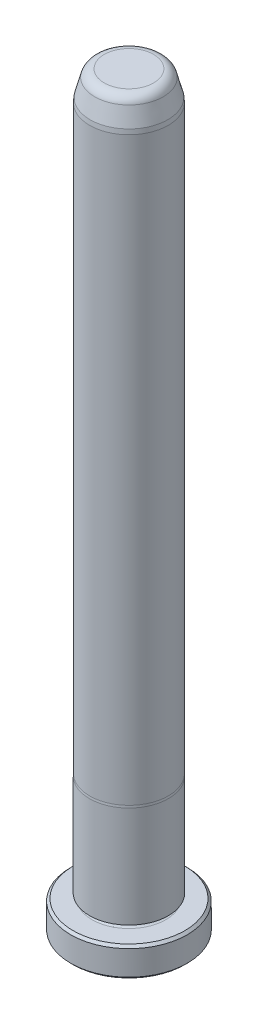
ISO-10303-21;
HEADER;
FILE_DESCRIPTION(('STEP AP214'),'2;1');
FILE_NAME('part.step','',(''),(''),'','','');
FILE_SCHEMA(('AUTOMOTIVE_DESIGN { 1 0 10303 214 1 1 1 1 }'));
ENDSEC;
DATA;
#1=APPLICATION_CONTEXT('core data for automotive mechanical design processes');
#2=APPLICATION_PROTOCOL_DEFINITION('international standard','automotive_design',2000,#1);
#3=PRODUCT_CONTEXT('',#1,'mechanical');
#4=PRODUCT('Part','Part','',(#3));
#5=PRODUCT_RELATED_PRODUCT_CATEGORY('part','',(#4));
#6=PRODUCT_DEFINITION_FORMATION('','',#4);
#7=PRODUCT_DEFINITION_CONTEXT('part definition',#1,'design');
#8=PRODUCT_DEFINITION('design','',#6,#7);
#9=PRODUCT_DEFINITION_SHAPE('','',#8);
#10=(LENGTH_UNIT() NAMED_UNIT(*) SI_UNIT(.MILLI.,.METRE.));
#11=(NAMED_UNIT(*) PLANE_ANGLE_UNIT() SI_UNIT($,.RADIAN.));
#12=(NAMED_UNIT(*) SI_UNIT($,.STERADIAN.) SOLID_ANGLE_UNIT());
#13=UNCERTAINTY_MEASURE_WITH_UNIT(LENGTH_MEASURE(1.E-05),#10,'distance_accuracy_value','');
#14=(GEOMETRIC_REPRESENTATION_CONTEXT(3) GLOBAL_UNCERTAINTY_ASSIGNED_CONTEXT((#13)) GLOBAL_UNIT_ASSIGNED_CONTEXT((#10,
#11,#12)) REPRESENTATION_CONTEXT('',''));
#15=CARTESIAN_POINT('',(0.,0.,0.));
#16=DIRECTION('',(0.,0.,1.));
#17=DIRECTION('',(1.,0.,0.));
#18=AXIS2_PLACEMENT_3D('',#15,#16,#17);
#19=CARTESIAN_POINT('',(0.,0.,0.));
#20=DIRECTION('',(0.,1.,0.));
#21=DIRECTION('',(0.,0.,1.));
#22=AXIS2_PLACEMENT_3D('',#19,#20,#21);
#23=PLANE('',#22);
#24=CARTESIAN_POINT('',(0.,0.,0.));
#25=DIRECTION('',(0.,1.,0.));
#26=DIRECTION('',(0.,0.,1.));
#27=AXIS2_PLACEMENT_3D('',#24,#25,#26);
#28=CIRCLE('',#27,9.01700000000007);
#29=CARTESIAN_POINT('',(0.,-1.43377027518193E-13,9.01700000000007));
#30=VERTEX_POINT('',#29);
#31=EDGE_CURVE('E37',#30,#30,#28,.F.);
#32=ORIENTED_EDGE('',*,*,#31,.T.);
#33=EDGE_LOOP('',(#32));
#34=FACE_BOUND('',#33,.T.);
#35=ADVANCED_FACE('F30',(#34),#23,.F.);
#36=CARTESIAN_POINT('',(0.,0.,0.));
#37=DIRECTION('',(0.,1.,0.));
#38=DIRECTION('',(0.,0.,1.));
#39=AXIS2_PLACEMENT_3D('',#36,#37,#38);
#40=CYLINDRICAL_SURFACE('',#39,9.39800000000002);
#41=CARTESIAN_POINT('',(0.,0.380999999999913,0.));
#42=DIRECTION('',(0.,1.,0.));
#43=DIRECTION('',(0.,0.,1.));
#44=AXIS2_PLACEMENT_3D('',#41,#42,#43);
#45=CIRCLE('',#44,9.39800000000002);
#46=CARTESIAN_POINT('',(0.,0.380999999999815,9.39800000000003));
#47=VERTEX_POINT('',#46);
#48=EDGE_CURVE('E41',#47,#47,#45,.T.);
#49=ORIENTED_EDGE('',*,*,#48,.T.);
#50=EDGE_LOOP('',(#49));
#51=FACE_BOUND('',#50,.T.);
#52=CARTESIAN_POINT('',(0.,4.36879999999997,0.));
#53=DIRECTION('',(0.,-1.,0.));
#54=DIRECTION('',(0.,0.,-1.));
#55=AXIS2_PLACEMENT_3D('',#52,#53,#54);
#56=CIRCLE('',#55,9.39800000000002);
#57=CARTESIAN_POINT('',(0.,4.36880000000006,-9.39799999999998));
#58=VERTEX_POINT('',#57);
#59=EDGE_CURVE('E45',#58,#58,#56,.T.);
#60=ORIENTED_EDGE('',*,*,#59,.T.);
#61=EDGE_LOOP('',(#60));
#62=FACE_BOUND('',#61,.T.);
#63=ADVANCED_FACE('F118',(#51,#62),#40,.T.);
#64=CARTESIAN_POINT('',(0.,4.74980000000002,-9.398));
#65=DIRECTION('',(0.,-1.,0.));
#66=DIRECTION('',(0.,0.,-1.));
#67=AXIS2_PLACEMENT_3D('',#64,#65,#66);
#68=PLANE('',#67);
#69=CARTESIAN_POINT('',(0.,4.74979999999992,0.));
#70=DIRECTION('',(0.,-1.,0.));
#71=DIRECTION('',(0.,0.,-1.));
#72=AXIS2_PLACEMENT_3D('',#69,#70,#71);
#73=CIRCLE('',#72,9.01700000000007);
#74=CARTESIAN_POINT('',(0.,4.74980000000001,-9.01700000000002));
#75=VERTEX_POINT('',#74);
#76=EDGE_CURVE('E10',#75,#75,#73,.F.);
#77=ORIENTED_EDGE('',*,*,#76,.T.);
#78=EDGE_LOOP('',(#77));
#79=FACE_BOUND('',#78,.T.);
#80=CARTESIAN_POINT('',(0.,4.74979999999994,0.));
#81=DIRECTION('',(0.,1.,0.));
#82=DIRECTION('',(0.,0.,1.));
#83=AXIS2_PLACEMENT_3D('',#80,#81,#82);
#84=CIRCLE('',#83,5.95630000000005);
#85=CARTESIAN_POINT('',(0.,4.74979999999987,5.9563000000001));
#86=VERTEX_POINT('',#85);
#87=EDGE_CURVE('E56',#86,#86,#84,.T.);
#88=ORIENTED_EDGE('',*,*,#87,.F.);
#89=EDGE_LOOP('',(#88));
#90=FACE_BOUND('',#89,.T.);
#91=ADVANCED_FACE('F113',(#79,#90),#68,.F.);
#92=CARTESIAN_POINT('',(0.,5.13079999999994,0.));
#93=DIRECTION('',(0.,1.,0.));
#94=DIRECTION('',(0.,0.,1.));
#95=AXIS2_PLACEMENT_3D('',#92,#93,#94);
#96=TOROIDAL_SURFACE('',#95,5.95630000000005,0.381);
#97=CARTESIAN_POINT('',(0.,5.51179999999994,0.));
#98=DIRECTION('',(0.,1.,0.));
#99=DIRECTION('',(0.,0.,1.));
#100=AXIS2_PLACEMENT_3D('',#97,#98,#99);
#101=CIRCLE('',#100,5.95630000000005);
#102=CARTESIAN_POINT('',(0.,5.51179999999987,5.95630000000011));
#103=VERTEX_POINT('',#102);
#104=EDGE_CURVE('E59',#103,#103,#101,.T.);
#105=ORIENTED_EDGE('',*,*,#104,.F.);
#106=EDGE_LOOP('',(#105));
#107=FACE_BOUND('',#106,.T.);
#108=ORIENTED_EDGE('',*,*,#87,.T.);
#109=EDGE_LOOP('',(#108));
#110=FACE_BOUND('',#109,.T.);
#111=ADVANCED_FACE('F107',(#107,#110),#96,.F.);
#112=CARTESIAN_POINT('',(0.,5.5118,-5.9563));
#113=DIRECTION('',(0.,1.,0.));
#114=DIRECTION('',(0.,0.,1.));
#115=AXIS2_PLACEMENT_3D('',#112,#113,#114);
#116=PLANE('',#115);
#117=CARTESIAN_POINT('',(0.,5.51179999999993,0.));
#118=DIRECTION('',(0.,1.,0.));
#119=DIRECTION('',(0.,0.,1.));
#120=AXIS2_PLACEMENT_3D('',#117,#118,#119);
#121=CIRCLE('',#120,6.36270000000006);
#122=CARTESIAN_POINT('',(0.,5.51179999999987,6.36270000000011));
#123=VERTEX_POINT('',#122);
#124=EDGE_CURVE('E62',#123,#123,#121,.T.);
#125=ORIENTED_EDGE('',*,*,#124,.F.);
#126=EDGE_LOOP('',(#125));
#127=FACE_BOUND('',#126,.T.);
#128=ORIENTED_EDGE('',*,*,#104,.T.);
#129=EDGE_LOOP('',(#128));
#130=FACE_BOUND('',#129,.T.);
#131=ADVANCED_FACE('F101',(#127,#130),#116,.F.);
#132=CARTESIAN_POINT('',(0.,0.,0.));
#133=DIRECTION('',(0.,1.,0.));
#134=DIRECTION('',(0.,0.,1.));
#135=AXIS2_PLACEMENT_3D('',#132,#133,#134);
#136=CYLINDRICAL_SURFACE('',#135,6.36270000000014);
#137=CARTESIAN_POINT('',(0.,21.8617630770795,2.28526874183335E-13));
#138=DIRECTION('',(0.,1.,0.));
#139=DIRECTION('',(0.,0.,1.));
#140=AXIS2_PLACEMENT_3D('',#137,#138,#139);
#141=CIRCLE('',#140,6.36270000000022);
#142=CARTESIAN_POINT('',(0.,21.8617630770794,6.36270000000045));
#143=VERTEX_POINT('',#142);
#144=EDGE_CURVE('E65',#143,#143,#141,.T.);
#145=ORIENTED_EDGE('',*,*,#144,.F.);
#146=EDGE_LOOP('',(#145));
#147=FACE_BOUND('',#146,.T.);
#148=ORIENTED_EDGE('',*,*,#124,.T.);
#149=EDGE_LOOP('',(#148));
#150=FACE_BOUND('',#149,.T.);
#151=ADVANCED_FACE('F95',(#147,#150),#136,.T.);
#152=CARTESIAN_POINT('',(0.,21.8617630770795,2.28526874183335E-13));
#153=DIRECTION('',(0.,-1.,0.));
#154=DIRECTION('',(0.,0.,-1.));
#155=AXIS2_PLACEMENT_3D('',#152,#153,#154);
#156=CONICAL_SURFACE('',#155,6.36270000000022,0.0698131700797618);
#157=CARTESIAN_POINT('',(0.,22.2249999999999,2.32323887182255E-13));
#158=DIRECTION('',(0.,1.,0.));
#159=DIRECTION('',(0.,0.,1.));
#160=AXIS2_PLACEMENT_3D('',#157,#158,#159);
#161=CIRCLE('',#160,6.33730000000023);
#162=CARTESIAN_POINT('',(0.,22.2249999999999,6.33730000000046));
#163=VERTEX_POINT('',#162);
#164=EDGE_CURVE('E68',#163,#163,#161,.T.);
#165=ORIENTED_EDGE('',*,*,#164,.F.);
#166=EDGE_LOOP('',(#165));
#167=FACE_BOUND('',#166,.T.);
#168=ORIENTED_EDGE('',*,*,#144,.T.);
#169=EDGE_LOOP('',(#168));
#170=FACE_BOUND('',#169,.T.);
#171=ADVANCED_FACE('F89',(#167,#170),#156,.T.);
#172=CARTESIAN_POINT('',(0.,0.,0.));
#173=DIRECTION('',(0.,1.,0.));
#174=DIRECTION('',(0.,0.,1.));
#175=AXIS2_PLACEMENT_3D('',#172,#173,#174);
#176=CYLINDRICAL_SURFACE('',#175,6.33730000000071);
#177=CARTESIAN_POINT('',(0.,115.9002,1.21153588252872E-12));
#178=DIRECTION('',(0.,1.,0.));
#179=DIRECTION('',(0.,0.,1.));
#180=AXIS2_PLACEMENT_3D('',#177,#178,#179);
#181=CIRCLE('',#180,6.33730000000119);
#182=CARTESIAN_POINT('',(0.,115.9002,6.3373000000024));
#183=VERTEX_POINT('',#182);
#184=EDGE_CURVE('E71',#183,#183,#181,.T.);
#185=ORIENTED_EDGE('',*,*,#184,.F.);
#186=EDGE_LOOP('',(#185));
#187=FACE_BOUND('',#186,.T.);
#188=ORIENTED_EDGE('',*,*,#164,.T.);
#189=EDGE_LOOP('',(#188));
#190=FACE_BOUND('',#189,.T.);
#191=ADVANCED_FACE('F83',(#187,#190),#176,.T.);
#192=CARTESIAN_POINT('',(0.,115.9002,1.21153588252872E-12));
#193=DIRECTION('',(0.,-1.,0.));
#194=DIRECTION('',(0.,0.,-1.));
#195=AXIS2_PLACEMENT_3D('',#192,#193,#194);
#196=CONICAL_SURFACE('',#195,6.33730000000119,0.0872664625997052);
#197=CARTESIAN_POINT('',(0.,116.6622,1.2195012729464E-12));
#198=DIRECTION('',(0.,1.,0.));
#199=DIRECTION('',(0.,0.,1.));
#200=AXIS2_PLACEMENT_3D('',#197,#198,#199);
#201=CIRCLE('',#200,6.27063363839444);
#202=CARTESIAN_POINT('',(0.,116.6622,6.27063363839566));
#203=VERTEX_POINT('',#202);
#204=EDGE_CURVE('E74',#203,#203,#201,.T.);
#205=ORIENTED_EDGE('',*,*,#204,.F.);
#206=EDGE_LOOP('',(#205));
#207=FACE_BOUND('',#206,.T.);
#208=ORIENTED_EDGE('',*,*,#184,.T.);
#209=EDGE_LOOP('',(#208));
#210=FACE_BOUND('',#209,.T.);
#211=ADVANCED_FACE('F80',(#207,#210),#196,.T.);
#212=CARTESIAN_POINT('',(0.,116.6622,1.2195012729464E-12));
#213=DIRECTION('',(0.,-1.,0.));
#214=DIRECTION('',(0.,0.,-1.));
#215=AXIS2_PLACEMENT_3D('',#212,#213,#214);
#216=CONICAL_SURFACE('',#215,6.27063363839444,0.26179938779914);
#217=CARTESIAN_POINT('',(0.,119.4733752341,1.24888724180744E-12));
#218=DIRECTION('',(0.,1.,0.));
#219=DIRECTION('',(0.,0.,1.));
#220=AXIS2_PLACEMENT_3D('',#217,#218,#219);
#221=CIRCLE('',#220,5.51738150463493);
#222=CARTESIAN_POINT('',(0.,119.4733752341,5.51738150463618));
#223=VERTEX_POINT('',#222);
#224=EDGE_CURVE('E50',#223,#223,#221,.F.);
#225=ORIENTED_EDGE('',*,*,#224,.T.);
#226=EDGE_LOOP('',(#225));
#227=FACE_BOUND('',#226,.T.);
#228=ORIENTED_EDGE('',*,*,#204,.T.);
#229=EDGE_LOOP('',(#228));
#230=FACE_BOUND('',#229,.T.);
#231=ADVANCED_FACE('F78',(#227,#230),#216,.T.);
#232=CARTESIAN_POINT('',(0.,120.65,-5.20210584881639));
#233=DIRECTION('',(0.,-1.,0.));
#234=DIRECTION('',(0.,0.,-1.));
#235=AXIS2_PLACEMENT_3D('',#232,#233,#234);
#236=PLANE('',#235);
#237=CARTESIAN_POINT('',(0.,120.65,1.26118681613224E-12));
#238=DIRECTION('',(0.,-1.,0.));
#239=DIRECTION('',(0.,0.,-1.));
#240=AXIS2_PLACEMENT_3D('',#237,#238,#239);
#241=CIRCLE('',#240,3.98397425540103);
#242=CARTESIAN_POINT('',(0.,120.65,-3.98397425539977));
#243=VERTEX_POINT('',#242);
#244=EDGE_CURVE('E53',#243,#243,#241,.F.);
#245=ORIENTED_EDGE('',*,*,#244,.T.);
#246=EDGE_LOOP('',(#245));
#247=FACE_BOUND('',#246,.T.);
#248=ADVANCED_FACE('F133',(#247),#236,.F.);
#249=CARTESIAN_POINT('',(0.,119.0625,1.24459225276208E-12));
#250=DIRECTION('',(0.,-1.,0.));
#251=DIRECTION('',(0.,0.,-1.));
#252=AXIS2_PLACEMENT_3D('',#249,#250,#251);
#253=TOROIDAL_SURFACE('',#252,3.98397425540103,1.5875);
#254=ORIENTED_EDGE('',*,*,#224,.F.);
#255=EDGE_LOOP('',(#254));
#256=FACE_BOUND('',#255,.T.);
#257=ORIENTED_EDGE('',*,*,#244,.F.);
#258=EDGE_LOOP('',(#257));
#259=FACE_BOUND('',#258,.T.);
#260=ADVANCED_FACE('F130',(#256,#259),#253,.T.);
#261=CARTESIAN_POINT('',(0.,0.380999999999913,0.));
#262=DIRECTION('',(0.,1.,0.));
#263=DIRECTION('',(0.,0.,1.));
#264=AXIS2_PLACEMENT_3D('',#261,#262,#263);
#265=CONICAL_SURFACE('',#264,9.39800000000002,0.785398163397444);
#266=ORIENTED_EDGE('',*,*,#31,.F.);
#267=EDGE_LOOP('',(#266));
#268=FACE_BOUND('',#267,.T.);
#269=ORIENTED_EDGE('',*,*,#48,.F.);
#270=EDGE_LOOP('',(#269));
#271=FACE_BOUND('',#270,.T.);
#272=ADVANCED_FACE('F132',(#268,#271),#265,.T.);
#273=CARTESIAN_POINT('',(0.,4.74979999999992,0.));
#274=DIRECTION('',(0.,-1.,0.));
#275=DIRECTION('',(0.,0.,-1.));
#276=AXIS2_PLACEMENT_3D('',#273,#274,#275);
#277=CONICAL_SURFACE('',#276,9.01700000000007,0.785398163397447);
#278=ORIENTED_EDGE('',*,*,#59,.F.);
#279=EDGE_LOOP('',(#278));
#280=FACE_BOUND('',#279,.T.);
#281=ORIENTED_EDGE('',*,*,#76,.F.);
#282=EDGE_LOOP('',(#281));
#283=FACE_BOUND('',#282,.T.);
#284=ADVANCED_FACE('F32',(#280,#283),#277,.T.);
#285=CLOSED_SHELL('',(#35,#63,#91,#111,#131,#151,#171,#191,#211,#231,#248,#260,#272,#284));
#286=MANIFOLD_SOLID_BREP('B2',#285);
#287=ADVANCED_BREP_SHAPE_REPRESENTATION('',(#18,#286),#14);
#288=SHAPE_DEFINITION_REPRESENTATION(#9,#287);
ENDSEC;
END-ISO-10303-21;
